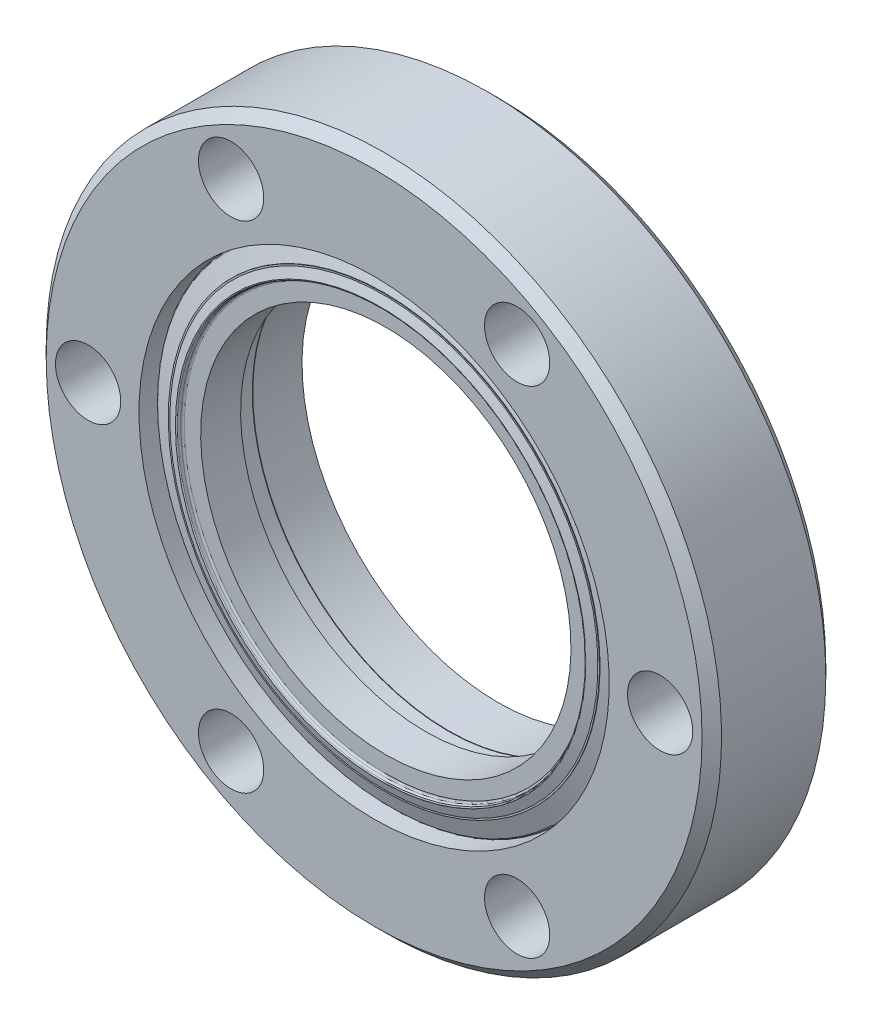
ISO-10303-21;
HEADER;
FILE_DESCRIPTION(('STEP AP214'),'2;1');
FILE_NAME('part.step','',(''),(''),'','','');
FILE_SCHEMA(('AUTOMOTIVE_DESIGN { 1 0 10303 214 1 1 1 1 }'));
ENDSEC;
DATA;
#1=APPLICATION_CONTEXT('core data for automotive mechanical design processes');
#2=APPLICATION_PROTOCOL_DEFINITION('international standard','automotive_design',2000,#1);
#3=PRODUCT_CONTEXT('',#1,'mechanical');
#4=PRODUCT('Part','Part','',(#3));
#5=PRODUCT_RELATED_PRODUCT_CATEGORY('part','',(#4));
#6=PRODUCT_DEFINITION_FORMATION('','',#4);
#7=PRODUCT_DEFINITION_CONTEXT('part definition',#1,'design');
#8=PRODUCT_DEFINITION('design','',#6,#7);
#9=PRODUCT_DEFINITION_SHAPE('','',#8);
#10=(LENGTH_UNIT() NAMED_UNIT(*) SI_UNIT(.MILLI.,.METRE.));
#11=(NAMED_UNIT(*) PLANE_ANGLE_UNIT() SI_UNIT($,.RADIAN.));
#12=(NAMED_UNIT(*) SI_UNIT($,.STERADIAN.) SOLID_ANGLE_UNIT());
#13=UNCERTAINTY_MEASURE_WITH_UNIT(LENGTH_MEASURE(1.E-05),#10,'distance_accuracy_value','');
#14=(GEOMETRIC_REPRESENTATION_CONTEXT(3) GLOBAL_UNCERTAINTY_ASSIGNED_CONTEXT((#13)) GLOBAL_UNIT_ASSIGNED_CONTEXT((#10,
#11,#12)) REPRESENTATION_CONTEXT('',''));
#15=CARTESIAN_POINT('',(0.,0.,0.));
#16=DIRECTION('',(0.,0.,1.));
#17=DIRECTION('',(1.,0.,0.));
#18=AXIS2_PLACEMENT_3D('',#15,#16,#17);
#19=CARTESIAN_POINT('',(0.,0.,11.9352703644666));
#20=DIRECTION('',(0.,0.,1.));
#21=DIRECTION('',(1.,0.,0.));
#22=AXIS2_PLACEMENT_3D('',#19,#20,#21);
#23=TOROIDAL_SURFACE('',#22,21.027786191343,0.0999999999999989);
#24=CARTESIAN_POINT('',(0.,0.,12.0292396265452));
#25=DIRECTION('',(0.,0.,-1.));
#26=DIRECTION('',(-1.,0.,0.));
#27=AXIS2_PLACEMENT_3D('',#24,#25,#26);
#28=CIRCLE('',#27,21.0619882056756);
#29=CARTESIAN_POINT('',(-21.0619882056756,0.,12.0292396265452));
#30=VERTEX_POINT('',#29);
#31=EDGE_CURVE('E131',#30,#30,#28,.T.);
#32=ORIENTED_EDGE('',*,*,#31,.F.);
#33=EDGE_LOOP('',(#32));
#34=FACE_BOUND('',#33,.T.);
#35=CARTESIAN_POINT('',(0.,0.,11.9526351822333));
#36=DIRECTION('',(0.,0.,1.));
#37=DIRECTION('',(1.,0.,0.));
#38=AXIS2_PLACEMENT_3D('',#35,#36,#37);
#39=CIRCLE('',#38,20.9293054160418);
#40=CARTESIAN_POINT('',(20.9293054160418,0.,11.9526351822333));
#41=VERTEX_POINT('',#40);
#42=EDGE_CURVE('E53',#41,#41,#39,.F.);
#43=ORIENTED_EDGE('',*,*,#42,.T.);
#44=EDGE_LOOP('',(#43));
#45=FACE_BOUND('',#44,.T.);
#46=ADVANCED_FACE('F16',(#34,#45),#23,.T.);
#47=CARTESIAN_POINT('',(0.,0.,11.7));
#48=DIRECTION('',(0.,0.,-1.));
#49=DIRECTION('',(-1.,0.,0.));
#50=AXIS2_PLACEMENT_3D('',#47,#48,#49);
#51=CONICAL_SURFACE('',#50,21.9665666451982,1.22173047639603);
#52=CARTESIAN_POINT('',(0.,0.,11.7));
#53=DIRECTION('',(0.,0.,-1.));
#54=DIRECTION('',(-1.,0.,0.));
#55=AXIS2_PLACEMENT_3D('',#52,#53,#54);
#56=CIRCLE('',#55,21.9665666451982);
#57=CARTESIAN_POINT('',(-21.9665666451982,0.,11.7));
#58=VERTEX_POINT('',#57);
#59=EDGE_CURVE('E49',#58,#58,#56,.T.);
#60=ORIENTED_EDGE('',*,*,#59,.F.);
#61=EDGE_LOOP('',(#60));
#62=FACE_BOUND('',#61,.T.);
#63=ORIENTED_EDGE('',*,*,#31,.T.);
#64=EDGE_LOOP('',(#63));
#65=FACE_BOUND('',#64,.T.);
#66=ADVANCED_FACE('F305',(#62,#65),#51,.T.);
#67=CARTESIAN_POINT('',(0.,0.,11.9526351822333));
#68=DIRECTION('',(0.,0.,1.));
#69=DIRECTION('',(1.,0.,0.));
#70=AXIS2_PLACEMENT_3D('',#67,#68,#69);
#71=CONICAL_SURFACE('',#70,20.9293054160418,0.174532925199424);
#72=ORIENTED_EDGE('',*,*,#42,.F.);
#73=EDGE_LOOP('',(#72));
#74=FACE_BOUND('',#73,.T.);
#75=CARTESIAN_POINT('',(0.,0.,11.6652703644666));
#76=DIRECTION('',(0.,0.,1.));
#77=DIRECTION('',(1.,0.,0.));
#78=AXIS2_PLACEMENT_3D('',#75,#76,#77);
#79=CIRCLE('',#78,20.8786352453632);
#80=CARTESIAN_POINT('',(20.8786352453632,0.,11.6652703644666));
#81=VERTEX_POINT('',#80);
#82=EDGE_CURVE('E52',#81,#81,#79,.F.);
#83=ORIENTED_EDGE('',*,*,#82,.T.);
#84=EDGE_LOOP('',(#83));
#85=FACE_BOUND('',#84,.T.);
#86=ADVANCED_FACE('F300',(#74,#85),#71,.F.);
#87=CARTESIAN_POINT('',(0.,23.925,11.7));
#88=DIRECTION('',(0.,0.,1.));
#89=DIRECTION('',(0.,-1.,0.));
#90=AXIS2_PLACEMENT_3D('',#87,#88,#89);
#91=PLANE('',#90);
#92=ORIENTED_EDGE('',*,*,#59,.T.);
#93=EDGE_LOOP('',(#92));
#94=FACE_BOUND('',#93,.T.);
#95=CARTESIAN_POINT('',(0.,0.,11.7));
#96=DIRECTION('',(0.,0.,-1.));
#97=DIRECTION('',(0.,1.,0.));
#98=AXIS2_PLACEMENT_3D('',#95,#96,#97);
#99=CIRCLE('',#98,22.125);
#100=CARTESIAN_POINT('',(0.,22.125,11.7));
#101=VERTEX_POINT('',#100);
#102=EDGE_CURVE('E47',#101,#101,#99,.T.);
#103=ORIENTED_EDGE('',*,*,#102,.F.);
#104=EDGE_LOOP('',(#103));
#105=FACE_BOUND('',#104,.T.);
#106=ADVANCED_FACE('F152',(#94,#105),#91,.T.);
#107=CARTESIAN_POINT('',(0.,0.,11.7));
#108=DIRECTION('',(0.,0.,1.));
#109=DIRECTION('',(1.,0.,0.));
#110=AXIS2_PLACEMENT_3D('',#107,#108,#109);
#111=TOROIDAL_SURFACE('',#110,20.6816736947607,0.200000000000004);
#112=ORIENTED_EDGE('',*,*,#82,.F.);
#113=EDGE_LOOP('',(#112));
#114=FACE_BOUND('',#113,.T.);
#115=CARTESIAN_POINT('',(0.,0.,11.5));
#116=DIRECTION('',(0.,0.,-1.));
#117=DIRECTION('',(1.,0.,0.));
#118=AXIS2_PLACEMENT_3D('',#115,#116,#117);
#119=CIRCLE('',#118,20.6816736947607);
#120=CARTESIAN_POINT('',(-20.6816736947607,0.,11.5));
#121=VERTEX_POINT('',#120);
#122=CARTESIAN_POINT('',(20.6816736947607,0.,11.5));
#123=VERTEX_POINT('',#122);
#124=EDGE_CURVE('E37',#121,#123,#119,.F.);
#125=ORIENTED_EDGE('',*,*,#124,.F.);
#126=CARTESIAN_POINT('',(0.,0.,11.5));
#127=DIRECTION('',(0.,0.,-1.));
#128=DIRECTION('',(-1.,0.,0.));
#129=AXIS2_PLACEMENT_3D('',#126,#127,#128);
#130=CIRCLE('',#129,20.6816736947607);
#131=EDGE_CURVE('E34',#123,#121,#130,.F.);
#132=ORIENTED_EDGE('',*,*,#131,.F.);
#133=EDGE_LOOP('',(#125,#132));
#134=FACE_BOUND('',#133,.T.);
#135=ADVANCED_FACE('F46',(#114,#134),#111,.F.);
#136=CARTESIAN_POINT('',(0.,0.,-24.6064148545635));
#137=DIRECTION('',(0.,0.,-1.));
#138=DIRECTION('',(0.,1.,0.));
#139=AXIS2_PLACEMENT_3D('',#136,#137,#138);
#140=CYLINDRICAL_SURFACE('',#139,22.125);
#141=CARTESIAN_POINT('',(0.,0.,11.6423349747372));
#142=DIRECTION('',(0.,0.,-1.));
#143=DIRECTION('',(-1.,0.,0.));
#144=AXIS2_PLACEMENT_3D('',#141,#142,#143);
#145=CIRCLE('',#144,22.125);
#146=CARTESIAN_POINT('',(-22.125,0.,11.6423349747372));
#147=VERTEX_POINT('',#146);
#148=EDGE_CURVE('E43',#147,#147,#145,.T.);
#149=ORIENTED_EDGE('',*,*,#148,.F.);
#150=EDGE_LOOP('',(#149));
#151=FACE_BOUND('',#150,.T.);
#152=ORIENTED_EDGE('',*,*,#102,.T.);
#153=EDGE_LOOP('',(#152));
#154=FACE_BOUND('',#153,.T.);
#155=ADVANCED_FACE('F151',(#151,#154),#140,.T.);
#156=CARTESIAN_POINT('',(0.,0.,11.5));
#157=DIRECTION('',(0.,0.,1.));
#158=DIRECTION('',(0.,-1.,0.));
#159=AXIS2_PLACEMENT_3D('',#156,#157,#158);
#160=PLANE('',#159);
#161=ORIENTED_EDGE('',*,*,#131,.T.);
#162=ORIENTED_EDGE('',*,*,#124,.T.);
#163=EDGE_LOOP('',(#161,#162));
#164=FACE_BOUND('',#163,.T.);
#165=CARTESIAN_POINT('',(0.,0.,11.5));
#166=DIRECTION('',(0.,0.,1.));
#167=DIRECTION('',(0.,-1.,0.));
#168=AXIS2_PLACEMENT_3D('',#165,#166,#167);
#169=CIRCLE('',#168,19.);
#170=CARTESIAN_POINT('',(0.,-19.,11.5));
#171=VERTEX_POINT('',#170);
#172=EDGE_CURVE('E56',#171,#171,#169,.F.);
#173=ORIENTED_EDGE('',*,*,#172,.T.);
#174=EDGE_LOOP('',(#173));
#175=FACE_BOUND('',#174,.T.);
#176=ADVANCED_FACE('F39',(#164,#175),#160,.T.);
#177=CARTESIAN_POINT('',(0.,0.,10.98958929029));
#178=DIRECTION('',(0.,0.,-1.));
#179=DIRECTION('',(-1.,0.,0.));
#180=AXIS2_PLACEMENT_3D('',#177,#178,#179);
#181=CONICAL_SURFACE('',#180,23.9184040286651,1.22173047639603);
#182=CARTESIAN_POINT('',(0.,0.,10.98958929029));
#183=DIRECTION('',(0.,0.,-1.));
#184=DIRECTION('',(-1.,0.,0.));
#185=AXIS2_PLACEMENT_3D('',#182,#183,#184);
#186=CIRCLE('',#185,23.9184040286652);
#187=CARTESIAN_POINT('',(-23.9184040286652,0.,10.98958929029));
#188=VERTEX_POINT('',#187);
#189=EDGE_CURVE('E59',#188,#188,#186,.T.);
#190=ORIENTED_EDGE('',*,*,#189,.F.);
#191=EDGE_LOOP('',(#190));
#192=FACE_BOUND('',#191,.T.);
#193=ORIENTED_EDGE('',*,*,#148,.T.);
#194=EDGE_LOOP('',(#193));
#195=FACE_BOUND('',#194,.T.);
#196=ADVANCED_FACE('F170',(#192,#195),#181,.T.);
#197=CARTESIAN_POINT('',(0.,0.,31.5));
#198=DIRECTION('',(0.,0.,1.));
#199=DIRECTION('',(0.,-1.,0.));
#200=AXIS2_PLACEMENT_3D('',#197,#198,#199);
#201=CYLINDRICAL_SURFACE('',#200,19.);
#202=ORIENTED_EDGE('',*,*,#172,.F.);
#203=EDGE_LOOP('',(#202));
#204=FACE_BOUND('',#203,.T.);
#205=CARTESIAN_POINT('',(0.,0.,7.39999999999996));
#206=DIRECTION('',(0.,0.,1.));
#207=DIRECTION('',(0.,-1.,0.));
#208=AXIS2_PLACEMENT_3D('',#205,#206,#207);
#209=CIRCLE('',#208,19.);
#210=CARTESIAN_POINT('',(0.,-19.,7.39999999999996));
#211=VERTEX_POINT('',#210);
#212=EDGE_CURVE('E60',#211,#211,#209,.T.);
#213=ORIENTED_EDGE('',*,*,#212,.F.);
#214=EDGE_LOOP('',(#213));
#215=FACE_BOUND('',#214,.T.);
#216=ADVANCED_FACE('F191',(#204,#215),#201,.F.);
#217=CARTESIAN_POINT('',(0.,0.,10.8016507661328));
#218=DIRECTION('',(0.,0.,-1.));
#219=DIRECTION('',(-1.,0.,0.));
#220=AXIS2_PLACEMENT_3D('',#217,#218,#219);
#221=TOROIDAL_SURFACE('',#220,23.85,0.200000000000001);
#222=CARTESIAN_POINT('',(0.,0.,10.8016507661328));
#223=DIRECTION('',(0.,0.,-1.));
#224=DIRECTION('',(0.,1.,0.));
#225=AXIS2_PLACEMENT_3D('',#222,#223,#224);
#226=CIRCLE('',#225,24.05);
#227=CARTESIAN_POINT('',(0.,24.05,10.8016507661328));
#228=VERTEX_POINT('',#227);
#229=EDGE_CURVE('E63',#228,#228,#226,.T.);
#230=ORIENTED_EDGE('',*,*,#229,.F.);
#231=EDGE_LOOP('',(#230));
#232=FACE_BOUND('',#231,.T.);
#233=ORIENTED_EDGE('',*,*,#189,.T.);
#234=EDGE_LOOP('',(#233));
#235=FACE_BOUND('',#234,.T.);
#236=ADVANCED_FACE('F187',(#232,#235),#221,.T.);
#237=CARTESIAN_POINT('',(0.,19.,7.39999999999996));
#238=DIRECTION('',(0.,0.,-1.));
#239=DIRECTION('',(0.,1.,0.));
#240=AXIS2_PLACEMENT_3D('',#237,#238,#239);
#241=PLANE('',#240);
#242=CARTESIAN_POINT('',(0.,0.,7.39999999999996));
#243=DIRECTION('',(0.,0.,1.));
#244=DIRECTION('',(0.,-1.,0.));
#245=AXIS2_PLACEMENT_3D('',#242,#243,#244);
#246=CIRCLE('',#245,20.1);
#247=CARTESIAN_POINT('',(0.,-20.1,7.39999999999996));
#248=VERTEX_POINT('',#247);
#249=EDGE_CURVE('E64',#248,#248,#246,.F.);
#250=ORIENTED_EDGE('',*,*,#249,.T.);
#251=EDGE_LOOP('',(#250));
#252=FACE_BOUND('',#251,.T.);
#253=ORIENTED_EDGE('',*,*,#212,.T.);
#254=EDGE_LOOP('',(#253));
#255=FACE_BOUND('',#254,.T.);
#256=ADVANCED_FACE('F190',(#252,#255),#241,.T.);
#257=CARTESIAN_POINT('',(0.,0.,-24.6064148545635));
#258=DIRECTION('',(0.,0.,-1.));
#259=DIRECTION('',(0.,1.,0.));
#260=AXIS2_PLACEMENT_3D('',#257,#258,#259);
#261=CYLINDRICAL_SURFACE('',#260,24.05);
#262=CARTESIAN_POINT('',(0.,0.,5.10000000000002));
#263=DIRECTION('',(0.,0.,-1.));
#264=DIRECTION('',(0.,1.,0.));
#265=AXIS2_PLACEMENT_3D('',#262,#263,#264);
#266=CIRCLE('',#265,24.05);
#267=CARTESIAN_POINT('',(0.,24.05,5.10000000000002));
#268=VERTEX_POINT('',#267);
#269=EDGE_CURVE('E67',#268,#268,#266,.F.);
#270=ORIENTED_EDGE('',*,*,#269,.T.);
#271=EDGE_LOOP('',(#270));
#272=FACE_BOUND('',#271,.T.);
#273=ORIENTED_EDGE('',*,*,#229,.T.);
#274=EDGE_LOOP('',(#273));
#275=FACE_BOUND('',#274,.T.);
#276=ADVANCED_FACE('F278',(#272,#275),#261,.T.);
#277=CARTESIAN_POINT('',(0.,0.,31.5));
#278=DIRECTION('',(0.,0.,1.));
#279=DIRECTION('',(0.,-1.,0.));
#280=AXIS2_PLACEMENT_3D('',#277,#278,#279);
#281=CYLINDRICAL_SURFACE('',#280,20.1);
#282=CARTESIAN_POINT('',(0.,0.,5.10000000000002));
#283=DIRECTION('',(0.,0.,1.));
#284=DIRECTION('',(0.,-1.,0.));
#285=AXIS2_PLACEMENT_3D('',#282,#283,#284);
#286=CIRCLE('',#285,20.1);
#287=CARTESIAN_POINT('',(0.,-20.1,5.10000000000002));
#288=VERTEX_POINT('',#287);
#289=EDGE_CURVE('E70',#288,#288,#286,.F.);
#290=ORIENTED_EDGE('',*,*,#289,.T.);
#291=EDGE_LOOP('',(#290));
#292=FACE_BOUND('',#291,.T.);
#293=ORIENTED_EDGE('',*,*,#249,.F.);
#294=EDGE_LOOP('',(#293));
#295=FACE_BOUND('',#294,.T.);
#296=ADVANCED_FACE('F275',(#292,#295),#281,.F.);
#297=CARTESIAN_POINT('',(0.,24.125,5.09999999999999));
#298=DIRECTION('',(0.,0.,-1.));
#299=DIRECTION('',(0.,1.,0.));
#300=AXIS2_PLACEMENT_3D('',#297,#298,#299);
#301=PLANE('',#300);
#302=ORIENTED_EDGE('',*,*,#269,.F.);
#303=EDGE_LOOP('',(#302));
#304=FACE_BOUND('',#303,.T.);
#305=CARTESIAN_POINT('',(0.,0.,5.10000000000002));
#306=DIRECTION('',(0.,0.,-1.));
#307=DIRECTION('',(0.,1.,0.));
#308=AXIS2_PLACEMENT_3D('',#305,#306,#307);
#309=CIRCLE('',#308,24.125);
#310=CARTESIAN_POINT('',(0.,24.125,5.10000000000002));
#311=VERTEX_POINT('',#310);
#312=EDGE_CURVE('E73',#311,#311,#309,.F.);
#313=ORIENTED_EDGE('',*,*,#312,.T.);
#314=EDGE_LOOP('',(#313));
#315=FACE_BOUND('',#314,.T.);
#316=ADVANCED_FACE('F271',(#304,#315),#301,.F.);
#317=CARTESIAN_POINT('',(0.,23.95,5.10000000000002));
#318=DIRECTION('',(0.,0.,1.));
#319=DIRECTION('',(0.,-1.,0.));
#320=AXIS2_PLACEMENT_3D('',#317,#318,#319);
#321=PLANE('',#320);
#322=CARTESIAN_POINT('',(0.,0.,5.10000000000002));
#323=DIRECTION('',(0.,0.,-1.));
#324=DIRECTION('',(0.,1.,0.));
#325=AXIS2_PLACEMENT_3D('',#322,#323,#324);
#326=CIRCLE('',#325,23.95);
#327=CARTESIAN_POINT('',(0.,23.95,5.10000000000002));
#328=VERTEX_POINT('',#327);
#329=EDGE_CURVE('E76',#328,#328,#326,.T.);
#330=ORIENTED_EDGE('',*,*,#329,.T.);
#331=EDGE_LOOP('',(#330));
#332=FACE_BOUND('',#331,.T.);
#333=ORIENTED_EDGE('',*,*,#289,.F.);
#334=EDGE_LOOP('',(#333));
#335=FACE_BOUND('',#334,.T.);
#336=ADVANCED_FACE('F267',(#332,#335),#321,.F.);
#337=CARTESIAN_POINT('',(0.,0.,-24.6064148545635));
#338=DIRECTION('',(0.,0.,-1.));
#339=DIRECTION('',(0.,1.,0.));
#340=AXIS2_PLACEMENT_3D('',#337,#338,#339);
#341=CYLINDRICAL_SURFACE('',#340,24.125);
#342=ORIENTED_EDGE('',*,*,#312,.F.);
#343=EDGE_LOOP('',(#342));
#344=FACE_BOUND('',#343,.T.);
#345=CARTESIAN_POINT('',(0.,0.,12.7));
#346=DIRECTION('',(0.,0.,-1.));
#347=DIRECTION('',(0.,1.,0.));
#348=AXIS2_PLACEMENT_3D('',#345,#346,#347);
#349=CIRCLE('',#348,24.125);
#350=CARTESIAN_POINT('',(0.,24.125,12.7));
#351=VERTEX_POINT('',#350);
#352=EDGE_CURVE('E80',#351,#351,#349,.T.);
#353=ORIENTED_EDGE('',*,*,#352,.F.);
#354=EDGE_LOOP('',(#353));
#355=FACE_BOUND('',#354,.T.);
#356=ADVANCED_FACE('F263',(#344,#355),#341,.F.);
#357=CARTESIAN_POINT('',(0.,0.,11.7));
#358=DIRECTION('',(0.,0.,-1.));
#359=DIRECTION('',(-1.,0.,0.));
#360=AXIS2_PLACEMENT_3D('',#357,#358,#359);
#361=CONICAL_SURFACE('',#360,34.6500000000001,0.785398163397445);
#362=CARTESIAN_POINT('',(0.,0.,11.7));
#363=DIRECTION('',(0.,0.,-1.));
#364=DIRECTION('',(0.,1.,0.));
#365=AXIS2_PLACEMENT_3D('',#362,#363,#364);
#366=CIRCLE('',#365,34.6500000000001);
#367=CARTESIAN_POINT('',(0.,34.6500000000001,11.7));
#368=VERTEX_POINT('',#367);
#369=EDGE_CURVE('E79',#368,#368,#366,.T.);
#370=ORIENTED_EDGE('',*,*,#369,.F.);
#371=EDGE_LOOP('',(#370));
#372=FACE_BOUND('',#371,.T.);
#373=CARTESIAN_POINT('',(0.,0.,12.7000000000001));
#374=DIRECTION('',(0.,0.,-1.));
#375=DIRECTION('',(-1.,0.,0.));
#376=AXIS2_PLACEMENT_3D('',#373,#374,#375);
#377=CIRCLE('',#376,33.65);
#378=CARTESIAN_POINT('',(-33.65,0.,12.7000000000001));
#379=VERTEX_POINT('',#378);
#380=EDGE_CURVE('E83',#379,#379,#377,.F.);
#381=ORIENTED_EDGE('',*,*,#380,.F.);
#382=EDGE_LOOP('',(#381));
#383=FACE_BOUND('',#382,.T.);
#384=ADVANCED_FACE('F259',(#372,#383),#361,.T.);
#385=CARTESIAN_POINT('',(0.,0.,-24.6064148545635));
#386=DIRECTION('',(0.,0.,-1.));
#387=DIRECTION('',(0.,1.,0.));
#388=AXIS2_PLACEMENT_3D('',#385,#386,#387);
#389=CYLINDRICAL_SURFACE('',#388,23.95);
#390=ORIENTED_EDGE('',*,*,#329,.F.);
#391=EDGE_LOOP('',(#390));
#392=FACE_BOUND('',#391,.T.);
#393=CARTESIAN_POINT('',(0.,0.,5.05000000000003));
#394=DIRECTION('',(0.,0.,-1.));
#395=DIRECTION('',(0.,1.,0.));
#396=AXIS2_PLACEMENT_3D('',#393,#394,#395);
#397=CIRCLE('',#396,23.95);
#398=CARTESIAN_POINT('',(0.,23.95,5.05000000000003));
#399=VERTEX_POINT('',#398);
#400=EDGE_CURVE('E86',#399,#399,#397,.T.);
#401=ORIENTED_EDGE('',*,*,#400,.T.);
#402=EDGE_LOOP('',(#401));
#403=FACE_BOUND('',#402,.T.);
#404=ADVANCED_FACE('F255',(#392,#403),#389,.F.);
#405=CARTESIAN_POINT('',(0.,0.,12.7));
#406=DIRECTION('',(0.,0.,-1.));
#407=DIRECTION('',(0.,1.,0.));
#408=AXIS2_PLACEMENT_3D('',#405,#406,#407);
#409=CYLINDRICAL_SURFACE('',#408,34.6500000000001);
#410=ORIENTED_EDGE('',*,*,#369,.T.);
#411=EDGE_LOOP('',(#410));
#412=FACE_BOUND('',#411,.T.);
#413=CARTESIAN_POINT('',(0.,0.,0.999999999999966));
#414=DIRECTION('',(0.,0.,1.));
#415=DIRECTION('',(1.,0.,0.));
#416=AXIS2_PLACEMENT_3D('',#413,#414,#415);
#417=CIRCLE('',#416,34.65);
#418=CARTESIAN_POINT('',(34.65,0.,0.999999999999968));
#419=VERTEX_POINT('',#418);
#420=EDGE_CURVE('E89',#419,#419,#417,.F.);
#421=ORIENTED_EDGE('',*,*,#420,.F.);
#422=EDGE_LOOP('',(#421));
#423=FACE_BOUND('',#422,.T.);
#424=ADVANCED_FACE('F251',(#412,#423),#409,.T.);
#425=CARTESIAN_POINT('',(0.,0.,12.7));
#426=DIRECTION('',(0.,0.,1.));
#427=DIRECTION('',(0.,-1.,0.));
#428=AXIS2_PLACEMENT_3D('',#425,#426,#427);
#429=PLANE('',#428);
#430=ORIENTED_EDGE('',*,*,#380,.T.);
#431=EDGE_LOOP('',(#430));
#432=FACE_BOUND('',#431,.T.);
#433=CARTESIAN_POINT('',(14.6749999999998,25.4178456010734,12.7));
#434=DIRECTION('',(0.,0.,1.));
#435=DIRECTION('',(0.,-1.,0.));
#436=AXIS2_PLACEMENT_3D('',#433,#434,#435);
#437=CIRCLE('',#436,3.35000000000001);
#438=CARTESIAN_POINT('',(14.6749999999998,22.0678456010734,12.7));
#439=VERTEX_POINT('',#438);
#440=EDGE_CURVE('E90',#439,#439,#437,.F.);
#441=ORIENTED_EDGE('',*,*,#440,.T.);
#442=EDGE_LOOP('',(#441));
#443=FACE_BOUND('',#442,.T.);
#444=CARTESIAN_POINT('',(-14.6750000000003,25.4178456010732,12.7));
#445=DIRECTION('',(0.,0.,1.));
#446=DIRECTION('',(0.,-1.,0.));
#447=AXIS2_PLACEMENT_3D('',#444,#445,#446);
#448=CIRCLE('',#447,3.35);
#449=CARTESIAN_POINT('',(-14.6750000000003,22.0678456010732,12.7));
#450=VERTEX_POINT('',#449);
#451=EDGE_CURVE('E93',#450,#450,#448,.F.);
#452=ORIENTED_EDGE('',*,*,#451,.T.);
#453=EDGE_LOOP('',(#452));
#454=FACE_BOUND('',#453,.T.);
#455=CARTESIAN_POINT('',(-29.3500000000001,-3.20434313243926E-13,12.7));
#456=DIRECTION('',(0.,0.,1.));
#457=DIRECTION('',(0.,-1.,0.));
#458=AXIS2_PLACEMENT_3D('',#455,#456,#457);
#459=CIRCLE('',#458,3.35000000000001);
#460=CARTESIAN_POINT('',(-29.3500000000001,-3.35000000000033,12.7));
#461=VERTEX_POINT('',#460);
#462=EDGE_CURVE('E96',#461,#461,#459,.F.);
#463=ORIENTED_EDGE('',*,*,#462,.T.);
#464=EDGE_LOOP('',(#463));
#465=FACE_BOUND('',#464,.T.);
#466=CARTESIAN_POINT('',(-14.6749999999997,-25.4178456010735,12.7));
#467=DIRECTION('',(0.,0.,1.));
#468=DIRECTION('',(0.,-1.,0.));
#469=AXIS2_PLACEMENT_3D('',#466,#467,#468);
#470=CIRCLE('',#469,3.35);
#471=CARTESIAN_POINT('',(-14.6749999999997,-28.7678456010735,12.7));
#472=VERTEX_POINT('',#471);
#473=EDGE_CURVE('E99',#472,#472,#470,.F.);
#474=ORIENTED_EDGE('',*,*,#473,.T.);
#475=EDGE_LOOP('',(#474));
#476=FACE_BOUND('',#475,.T.);
#477=CARTESIAN_POINT('',(14.6750000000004,-25.4178456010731,12.7));
#478=DIRECTION('',(0.,0.,1.));
#479=DIRECTION('',(0.,-1.,0.));
#480=AXIS2_PLACEMENT_3D('',#477,#478,#479);
#481=CIRCLE('',#480,3.35000000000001);
#482=CARTESIAN_POINT('',(14.6750000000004,-28.7678456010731,12.7));
#483=VERTEX_POINT('',#482);
#484=EDGE_CURVE('E102',#483,#483,#481,.F.);
#485=ORIENTED_EDGE('',*,*,#484,.T.);
#486=EDGE_LOOP('',(#485));
#487=FACE_BOUND('',#486,.T.);
#488=CARTESIAN_POINT('',(29.3500000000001,5.24376019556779E-13,12.7));
#489=DIRECTION('',(0.,0.,1.));
#490=DIRECTION('',(0.,-1.,0.));
#491=AXIS2_PLACEMENT_3D('',#488,#489,#490);
#492=CIRCLE('',#491,3.35000000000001);
#493=CARTESIAN_POINT('',(29.3500000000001,-3.34999999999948,12.7));
#494=VERTEX_POINT('',#493);
#495=EDGE_CURVE('E105',#494,#494,#492,.F.);
#496=ORIENTED_EDGE('',*,*,#495,.T.);
#497=EDGE_LOOP('',(#496));
#498=FACE_BOUND('',#497,.T.);
#499=ORIENTED_EDGE('',*,*,#352,.T.);
#500=EDGE_LOOP('',(#499));
#501=FACE_BOUND('',#500,.T.);
#502=ADVANCED_FACE('F247',(#432,#443,#454,#465,#476,#487,#498,#501),#429,.T.);
#503=CARTESIAN_POINT('',(0.,19.8,5.05000000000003));
#504=DIRECTION('',(0.,0.,-1.));
#505=DIRECTION('',(0.,1.,0.));
#506=AXIS2_PLACEMENT_3D('',#503,#504,#505);
#507=PLANE('',#506);
#508=ORIENTED_EDGE('',*,*,#400,.F.);
#509=EDGE_LOOP('',(#508));
#510=FACE_BOUND('',#509,.T.);
#511=CARTESIAN_POINT('',(0.,0.,5.05000000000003));
#512=DIRECTION('',(0.,0.,1.));
#513=DIRECTION('',(0.,-1.,0.));
#514=AXIS2_PLACEMENT_3D('',#511,#512,#513);
#515=CIRCLE('',#514,20.1);
#516=CARTESIAN_POINT('',(0.,-20.1,5.05000000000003));
#517=VERTEX_POINT('',#516);
#518=EDGE_CURVE('E108',#517,#517,#515,.F.);
#519=ORIENTED_EDGE('',*,*,#518,.T.);
#520=EDGE_LOOP('',(#519));
#521=FACE_BOUND('',#520,.T.);
#522=ADVANCED_FACE('F243',(#510,#521),#507,.F.);
#523=CARTESIAN_POINT('',(0.,0.,0.999999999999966));
#524=DIRECTION('',(0.,0.,1.));
#525=DIRECTION('',(1.,0.,0.));
#526=AXIS2_PLACEMENT_3D('',#523,#524,#525);
#527=CONICAL_SURFACE('',#526,34.65,0.785398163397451);
#528=CARTESIAN_POINT('',(0.,0.,0.));
#529=DIRECTION('',(0.,0.,1.));
#530=DIRECTION('',(1.,0.,0.));
#531=AXIS2_PLACEMENT_3D('',#528,#529,#530);
#532=CIRCLE('',#531,33.6500000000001);
#533=CARTESIAN_POINT('',(33.6500000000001,0.,0.));
#534=VERTEX_POINT('',#533);
#535=EDGE_CURVE('E111',#534,#534,#532,.T.);
#536=ORIENTED_EDGE('',*,*,#535,.T.);
#537=EDGE_LOOP('',(#536));
#538=FACE_BOUND('',#537,.T.);
#539=ORIENTED_EDGE('',*,*,#420,.T.);
#540=EDGE_LOOP('',(#539));
#541=FACE_BOUND('',#540,.T.);
#542=ADVANCED_FACE('F239',(#538,#541),#527,.T.);
#543=CARTESIAN_POINT('',(14.6749999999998,25.4178456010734,0.));
#544=DIRECTION('',(0.,0.,1.));
#545=DIRECTION('',(0.,-1.,0.));
#546=AXIS2_PLACEMENT_3D('',#543,#544,#545);
#547=CYLINDRICAL_SURFACE('',#546,3.35000000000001);
#548=CARTESIAN_POINT('',(14.6749999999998,25.4178456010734,0.));
#549=DIRECTION('',(0.,0.,1.));
#550=DIRECTION('',(0.,-1.,0.));
#551=AXIS2_PLACEMENT_3D('',#548,#549,#550);
#552=CIRCLE('',#551,3.35000000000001);
#553=CARTESIAN_POINT('',(14.6749999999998,22.0678456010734,0.));
#554=VERTEX_POINT('',#553);
#555=EDGE_CURVE('E114',#554,#554,#552,.F.);
#556=ORIENTED_EDGE('',*,*,#555,.T.);
#557=EDGE_LOOP('',(#556));
#558=FACE_BOUND('',#557,.T.);
#559=ORIENTED_EDGE('',*,*,#440,.F.);
#560=EDGE_LOOP('',(#559));
#561=FACE_BOUND('',#560,.T.);
#562=ADVANCED_FACE('F235',(#558,#561),#547,.F.);
#563=CARTESIAN_POINT('',(-14.6750000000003,25.4178456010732,0.));
#564=DIRECTION('',(0.,0.,1.));
#565=DIRECTION('',(0.,-1.,0.));
#566=AXIS2_PLACEMENT_3D('',#563,#564,#565);
#567=CYLINDRICAL_SURFACE('',#566,3.35);
#568=CARTESIAN_POINT('',(-14.6750000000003,25.4178456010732,0.));
#569=DIRECTION('',(0.,0.,1.));
#570=DIRECTION('',(0.,-1.,0.));
#571=AXIS2_PLACEMENT_3D('',#568,#569,#570);
#572=CIRCLE('',#571,3.35);
#573=CARTESIAN_POINT('',(-14.6750000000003,22.0678456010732,0.));
#574=VERTEX_POINT('',#573);
#575=EDGE_CURVE('E117',#574,#574,#572,.F.);
#576=ORIENTED_EDGE('',*,*,#575,.T.);
#577=EDGE_LOOP('',(#576));
#578=FACE_BOUND('',#577,.T.);
#579=ORIENTED_EDGE('',*,*,#451,.F.);
#580=EDGE_LOOP('',(#579));
#581=FACE_BOUND('',#580,.T.);
#582=ADVANCED_FACE('F231',(#578,#581),#567,.F.);
#583=CARTESIAN_POINT('',(-29.3500000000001,-3.20434313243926E-13,0.));
#584=DIRECTION('',(0.,0.,1.));
#585=DIRECTION('',(0.,-1.,0.));
#586=AXIS2_PLACEMENT_3D('',#583,#584,#585);
#587=CYLINDRICAL_SURFACE('',#586,3.35000000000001);
#588=CARTESIAN_POINT('',(-29.3500000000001,-3.20434313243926E-13,0.));
#589=DIRECTION('',(0.,0.,1.));
#590=DIRECTION('',(0.,-1.,0.));
#591=AXIS2_PLACEMENT_3D('',#588,#589,#590);
#592=CIRCLE('',#591,3.35000000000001);
#593=CARTESIAN_POINT('',(-29.3500000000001,-3.35000000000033,0.));
#594=VERTEX_POINT('',#593);
#595=EDGE_CURVE('E120',#594,#594,#592,.F.);
#596=ORIENTED_EDGE('',*,*,#595,.T.);
#597=EDGE_LOOP('',(#596));
#598=FACE_BOUND('',#597,.T.);
#599=ORIENTED_EDGE('',*,*,#462,.F.);
#600=EDGE_LOOP('',(#599));
#601=FACE_BOUND('',#600,.T.);
#602=ADVANCED_FACE('F227',(#598,#601),#587,.F.);
#603=CARTESIAN_POINT('',(-14.6749999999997,-25.4178456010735,0.));
#604=DIRECTION('',(0.,0.,1.));
#605=DIRECTION('',(0.,-1.,0.));
#606=AXIS2_PLACEMENT_3D('',#603,#604,#605);
#607=CYLINDRICAL_SURFACE('',#606,3.35);
#608=CARTESIAN_POINT('',(-14.6749999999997,-25.4178456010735,0.));
#609=DIRECTION('',(0.,0.,1.));
#610=DIRECTION('',(0.,-1.,0.));
#611=AXIS2_PLACEMENT_3D('',#608,#609,#610);
#612=CIRCLE('',#611,3.35);
#613=CARTESIAN_POINT('',(-14.6749999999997,-28.7678456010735,0.));
#614=VERTEX_POINT('',#613);
#615=EDGE_CURVE('E123',#614,#614,#612,.F.);
#616=ORIENTED_EDGE('',*,*,#615,.T.);
#617=EDGE_LOOP('',(#616));
#618=FACE_BOUND('',#617,.T.);
#619=ORIENTED_EDGE('',*,*,#473,.F.);
#620=EDGE_LOOP('',(#619));
#621=FACE_BOUND('',#620,.T.);
#622=ADVANCED_FACE('F223',(#618,#621),#607,.F.);
#623=CARTESIAN_POINT('',(14.6750000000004,-25.4178456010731,0.));
#624=DIRECTION('',(0.,0.,1.));
#625=DIRECTION('',(0.,-1.,0.));
#626=AXIS2_PLACEMENT_3D('',#623,#624,#625);
#627=CYLINDRICAL_SURFACE('',#626,3.35000000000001);
#628=CARTESIAN_POINT('',(14.6750000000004,-25.4178456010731,0.));
#629=DIRECTION('',(0.,0.,1.));
#630=DIRECTION('',(0.,-1.,0.));
#631=AXIS2_PLACEMENT_3D('',#628,#629,#630);
#632=CIRCLE('',#631,3.35000000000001);
#633=CARTESIAN_POINT('',(14.6750000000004,-28.7678456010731,0.));
#634=VERTEX_POINT('',#633);
#635=EDGE_CURVE('E126',#634,#634,#632,.F.);
#636=ORIENTED_EDGE('',*,*,#635,.T.);
#637=EDGE_LOOP('',(#636));
#638=FACE_BOUND('',#637,.T.);
#639=ORIENTED_EDGE('',*,*,#484,.F.);
#640=EDGE_LOOP('',(#639));
#641=FACE_BOUND('',#640,.T.);
#642=ADVANCED_FACE('F219',(#638,#641),#627,.F.);
#643=CARTESIAN_POINT('',(29.3500000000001,5.24376019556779E-13,0.));
#644=DIRECTION('',(0.,0.,1.));
#645=DIRECTION('',(0.,-1.,0.));
#646=AXIS2_PLACEMENT_3D('',#643,#644,#645);
#647=CYLINDRICAL_SURFACE('',#646,3.35000000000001);
#648=CARTESIAN_POINT('',(29.3500000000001,5.24376019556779E-13,0.));
#649=DIRECTION('',(0.,0.,1.));
#650=DIRECTION('',(0.,-1.,0.));
#651=AXIS2_PLACEMENT_3D('',#648,#649,#650);
#652=CIRCLE('',#651,3.35000000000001);
#653=CARTESIAN_POINT('',(29.3500000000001,-3.34999999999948,0.));
#654=VERTEX_POINT('',#653);
#655=EDGE_CURVE('E28',#654,#654,#652,.F.);
#656=ORIENTED_EDGE('',*,*,#655,.T.);
#657=EDGE_LOOP('',(#656));
#658=FACE_BOUND('',#657,.T.);
#659=ORIENTED_EDGE('',*,*,#495,.F.);
#660=EDGE_LOOP('',(#659));
#661=FACE_BOUND('',#660,.T.);
#662=ADVANCED_FACE('F211',(#658,#661),#647,.F.);
#663=CARTESIAN_POINT('',(0.,0.,31.5));
#664=DIRECTION('',(0.,0.,1.));
#665=DIRECTION('',(0.,-1.,0.));
#666=AXIS2_PLACEMENT_3D('',#663,#664,#665);
#667=CYLINDRICAL_SURFACE('',#666,20.1);
#668=CARTESIAN_POINT('',(0.,0.,0.));
#669=DIRECTION('',(0.,0.,1.));
#670=DIRECTION('',(0.,-1.,0.));
#671=AXIS2_PLACEMENT_3D('',#668,#669,#670);
#672=CIRCLE('',#671,20.1);
#673=CARTESIAN_POINT('',(0.,-20.1,0.));
#674=VERTEX_POINT('',#673);
#675=EDGE_CURVE('E11',#674,#674,#672,.F.);
#676=ORIENTED_EDGE('',*,*,#675,.T.);
#677=EDGE_LOOP('',(#676));
#678=FACE_BOUND('',#677,.T.);
#679=ORIENTED_EDGE('',*,*,#518,.F.);
#680=EDGE_LOOP('',(#679));
#681=FACE_BOUND('',#680,.T.);
#682=ADVANCED_FACE('F205',(#678,#681),#667,.F.);
#683=CARTESIAN_POINT('',(0.,0.,0.));
#684=DIRECTION('',(0.,0.,1.));
#685=DIRECTION('',(0.,-1.,0.));
#686=AXIS2_PLACEMENT_3D('',#683,#684,#685);
#687=PLANE('',#686);
#688=ORIENTED_EDGE('',*,*,#675,.F.);
#689=EDGE_LOOP('',(#688));
#690=FACE_BOUND('',#689,.T.);
#691=ORIENTED_EDGE('',*,*,#655,.F.);
#692=EDGE_LOOP('',(#691));
#693=FACE_BOUND('',#692,.T.);
#694=ORIENTED_EDGE('',*,*,#635,.F.);
#695=EDGE_LOOP('',(#694));
#696=FACE_BOUND('',#695,.T.);
#697=ORIENTED_EDGE('',*,*,#615,.F.);
#698=EDGE_LOOP('',(#697));
#699=FACE_BOUND('',#698,.T.);
#700=ORIENTED_EDGE('',*,*,#595,.F.);
#701=EDGE_LOOP('',(#700));
#702=FACE_BOUND('',#701,.T.);
#703=ORIENTED_EDGE('',*,*,#575,.F.);
#704=EDGE_LOOP('',(#703));
#705=FACE_BOUND('',#704,.T.);
#706=ORIENTED_EDGE('',*,*,#555,.F.);
#707=EDGE_LOOP('',(#706));
#708=FACE_BOUND('',#707,.T.);
#709=ORIENTED_EDGE('',*,*,#535,.F.);
#710=EDGE_LOOP('',(#709));
#711=FACE_BOUND('',#710,.T.);
#712=ADVANCED_FACE('F203',(#690,#693,#696,#699,#702,#705,#708,#711),#687,.F.);
#713=CLOSED_SHELL('',(#46,#66,#86,#106,#135,#155,#176,#196,#216,#236,#256,#276,#296,#316,#336,
#356,#384,#404,#424,#502,#522,#542,#562,#582,#602,#622,#642,#662,#682,#712));
#714=MANIFOLD_SOLID_BREP('B1',#713);
#715=ADVANCED_BREP_SHAPE_REPRESENTATION('',(#18,#714),#14);
#716=SHAPE_DEFINITION_REPRESENTATION(#9,#715);
ENDSEC;
END-ISO-10303-21;
